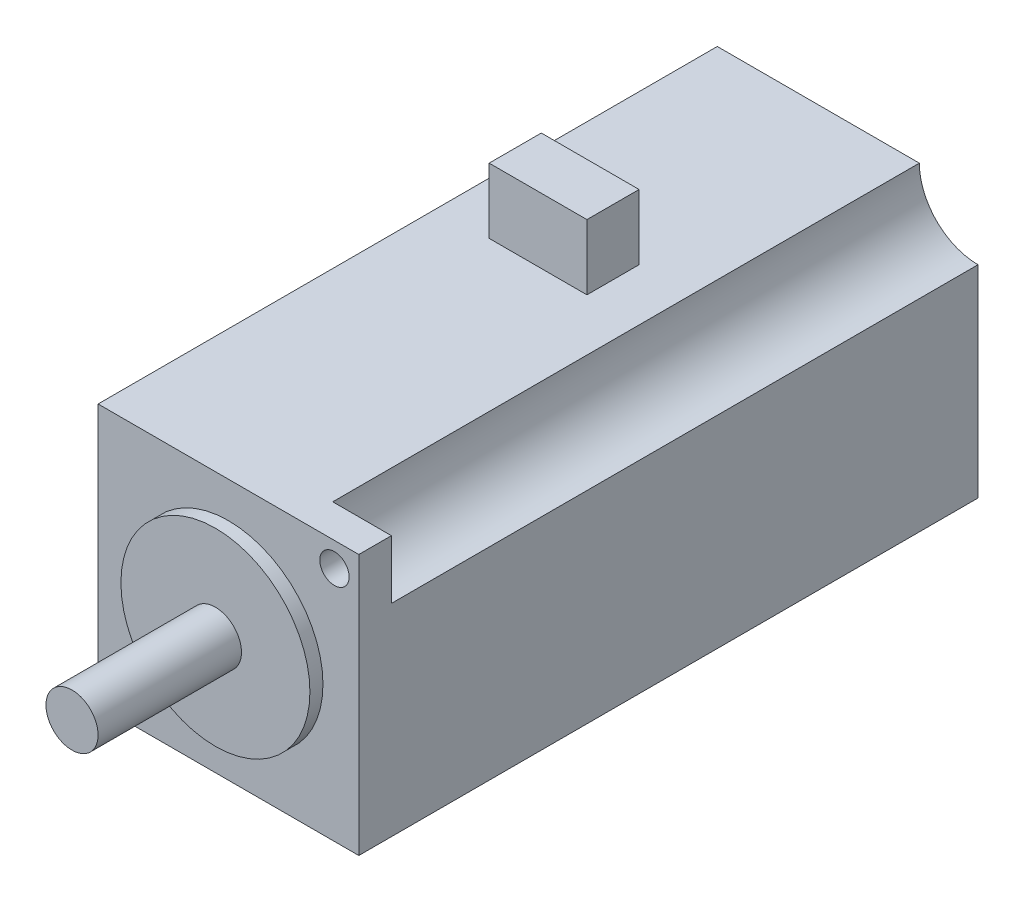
from build123d import *

# Parameters (mm, degrees)
SKETCH_1_W          = 40
SKETCH_1_H          = 40
SKETCH_1_R          = 2.25
EXTRUDE_1_DEPTH     = 95
SKETCH_2_R          = 14.5
EXTRUDE_2_DEPTH     = 2
SKETCH_3_R          = 4
EXTRUDE_3_DEPTH     = 22
SKETCH_4_R          = 9
CUT_EXTRUDE_1_DEPTH = 90
SKETCH_5_W          = 15
SKETCH_5_H          = 8
EXTRUDE_4_DEPTH     = 10


with BuildPart() as part:
    # Sketch 1 → Extrude 1 (new body)
    with BuildSketch(Plane.XY):
        with Locations((7194.090308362, -398.275127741)):
            Rectangle(SKETCH_1_W, SKETCH_1_H)
        with Locations((7210.35376433, -382.011671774)):
            Circle(SKETCH_1_R, mode=Mode.SUBTRACT)
        with Locations((7177.826852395, -414.538583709)):
            Circle(SKETCH_1_R, mode=Mode.SUBTRACT)
    extrude(amount=EXTRUDE_1_DEPTH)

    # Sketch 2 → Extrude 2 (add)
    with BuildSketch(Plane.XY.offset(95)):
        with Locations((7194.090308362, -398.275127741)):
            Circle(SKETCH_2_R)
    extrude(amount=EXTRUDE_2_DEPTH)

    # Sketch 3 → Extrude 3 (add)
    with BuildSketch(Plane.XY.offset(97)):
        with Locations((7194.090308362, -398.275127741)):
            Circle(SKETCH_3_R)
    extrude(amount=EXTRUDE_3_DEPTH)

    # Sketch 4 → Cut-Extrude 1 (cut)
    with BuildSketch(Plane(origin=(0, 0, 0), x_dir=(-1, 0, 0), z_dir=(0, 0, -1))):
        with Locations((-7214.090308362, -378.275127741)):
            Circle(SKETCH_4_R)
        with Locations((-7174.090308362, -418.275127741)):
            Circle(SKETCH_4_R)
    extrude(amount=-CUT_EXTRUDE_1_DEPTH, mode=Mode.SUBTRACT)

    # Sketch 5 → Extrude 4 (add)
    with BuildSketch(Plane(origin=(0, -378.275127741, 0), x_dir=(1, 0, 0), z_dir=(0, 1, 0))):
        with Locations((7189.590308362, -39)):
            Rectangle(SKETCH_5_W, SKETCH_5_H)
    extrude(amount=EXTRUDE_4_DEPTH)


solid = part.part
